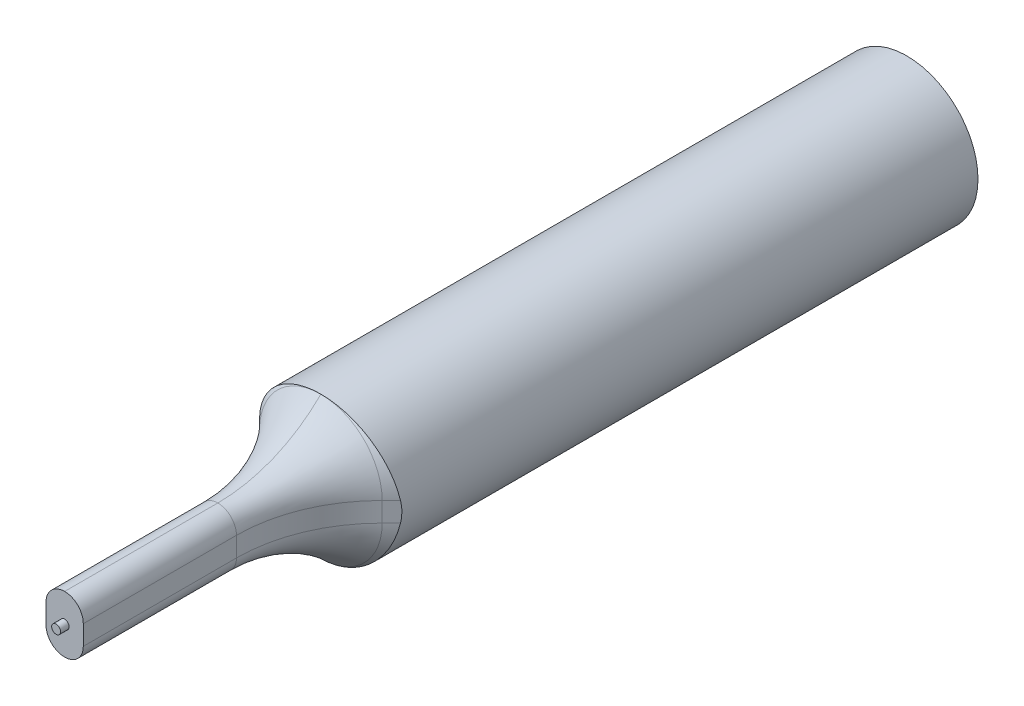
from build123d import *

# Parameters (mm, degrees)
LOGO3_BIB2_W        = 6.35
LOGO3_BIB2_H        = 75.1332
SKETCH3_R           = 0.396875
BOSS_EXTRUDE1_DEPTH = 0.762


with BuildPart() as part:
    # logo3_bib2 → Revolve2_Shoulder (revolve)
    with BuildSketch(Plane(origin=(0, 0, 0), x_dir=(1, 0, 0), z_dir=(0, 1, 0)), mode=Mode.PRIVATE) as revolve2_shoulder_sk:
        with Locations((-3.175, -32.7914)):
            Rectangle(LOGO3_BIB2_W, LOGO3_BIB2_H)
    revolve(revolve2_shoulder_sk.sketch.rotate(Axis((0, 0, 43.517168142), (0, 0, -1)), 180), axis=Axis((0, 0, 43.517168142), (0, 0, -1)))

    # Cut-Sweep1: sweep along a path in Sketch1
    with BuildLine(Plane.XY.offset(70.358)) as cut_sweep1_path:
        Line((1.6637, 0.87503), (1.6637, -0.87503))
        ThreePointArc((1.6637, -0.87503), (0, -2.53873), (-1.6637, -0.87503))
        Line((-1.6637, -0.87503), (-1.6637, 0.87503))
        ThreePointArc((-1.6637, 0.87503), (0, 2.53873), (1.6637, 0.87503))
    # Sketch2 → Cut-Sweep1 (sweep, cut)
    with BuildSketch(Plane(origin=(0, 0, 0), x_dir=(0, 0, -1), z_dir=(1, 0, 0))):
        with BuildLine():
            Line((-70.358, 2.53873), (-56.694044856, 2.53873))
            ThreePointArc((-56.694044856, 2.53873), (-51.719160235, 3.528296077), (-47.5016567, 6.346341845))
            Line((-47.5016567, 6.346341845), (-18.594044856, 35.253953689))
            Line((-18.594044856, 35.253953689), (-18.594044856, 53.33873))
            Line((-18.594044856, 53.33873), (-70.358, 53.33873))
            Line((-70.358, 53.33873), (-70.358, 2.53873))
        make_face()
    sweep(path=cut_sweep1_path.line, mode=Mode.SUBTRACT)

    # Sketch3 → Boss-Extrude1 (add)
    with BuildSketch(Plane.XY.offset(70.358)):
        with Locations(Location((0, 0, 0), (0, 0, 180))):
            Circle(SKETCH3_R)
    extrude(amount=BOSS_EXTRUDE1_DEPTH)

    # Sketch4 → Cut-Revolve1 (revolve, cut)
    with BuildSketch(Plane(origin=(0, 0, 0), x_dir=(0, 0, -1), z_dir=(0.8873494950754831, -0.46109746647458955, 0))):
        with BuildLine():
            Line((-22.0472, -9.398), (8.749696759, -9.398))
            Line((8.749696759, -9.398), (-14.577479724, -3.1475019))
            ThreePointArc((-14.577479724, -3.1475019), (-19.77226296, -4.528055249), (-22.0472, -9.398))
        make_face()
    revolve(axis=Axis((-4.33339399, -8.339310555, -8.749696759), (0, 0, 1)), mode=Mode.SUBTRACT)


solid = part.part
